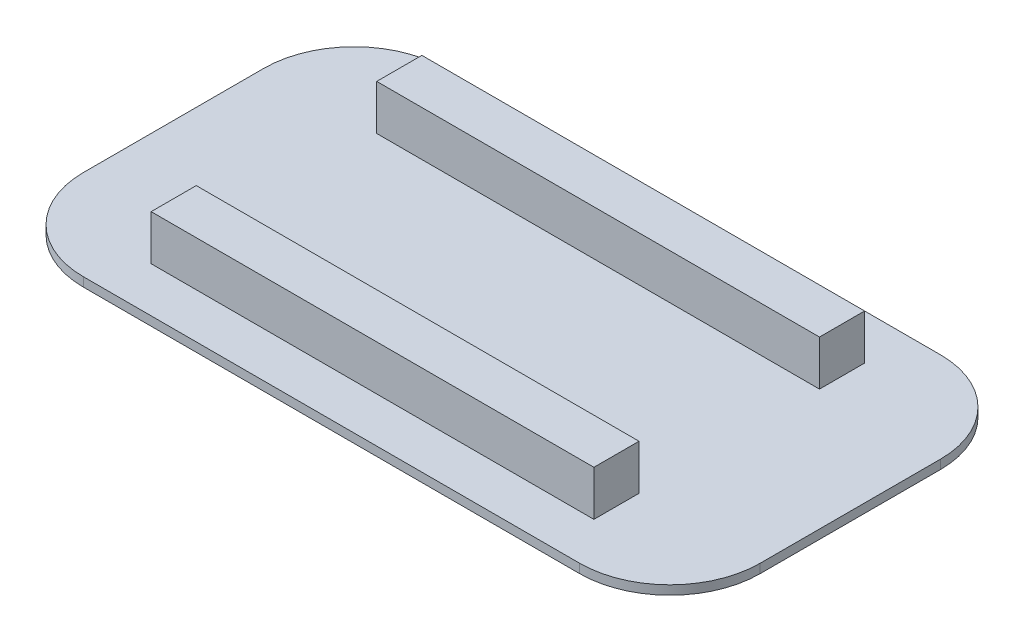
from build123d import *

# Parameters (mm, degrees)
SKIZZE1_W                       = 75
SKIZZE1_H                       = 40
AUFSATZ_LINEAR_AUSTRAGEN1_DEPTH = 1
VERRUNDUNG1_R                   = 10
SKIZZE2_W                       = 49.067623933
SKIZZE2_H                       = 5
AUFSATZ_LINEAR_AUSTRAGEN2_DEPTH = 5


with BuildPart() as part:
    # Skizze1 → Aufsatz-Linear austragen1 (new body)
    with BuildSketch(Plane(origin=(0, 0, 0), x_dir=(1, 0, 0), z_dir=(0, 1, 0))):
        Rectangle(SKIZZE1_W, SKIZZE1_H)
    extrude(amount=AUFSATZ_LINEAR_AUSTRAGEN1_DEPTH)

    # Verrundung1
    verrundung1_edges = [part.edges().sort_by_distance(p)[0] for p in [
        (-37.5, 0.5, -20),
        (37.5, 0.5, -20),
        (37.5, 0.5, 20),
        (-37.5, 0.5, 20),
    ]]
    fillet(verrundung1_edges, radius=VERRUNDUNG1_R)

    # Skizze2 → Aufsatz-Linear austragen2 (add)
    with BuildSketch(Plane(origin=(0, 1, 0), x_dir=(1, 0, 0), z_dir=(0, 1, 0))):
        with Locations((-0.45740445, -12.5)):
            Rectangle(SKIZZE2_W, SKIZZE2_H)
        with Locations((-0.45740445, 12.5)):
            Rectangle(SKIZZE2_W, SKIZZE2_H)
    extrude(amount=AUFSATZ_LINEAR_AUSTRAGEN2_DEPTH)


solid = part.part
